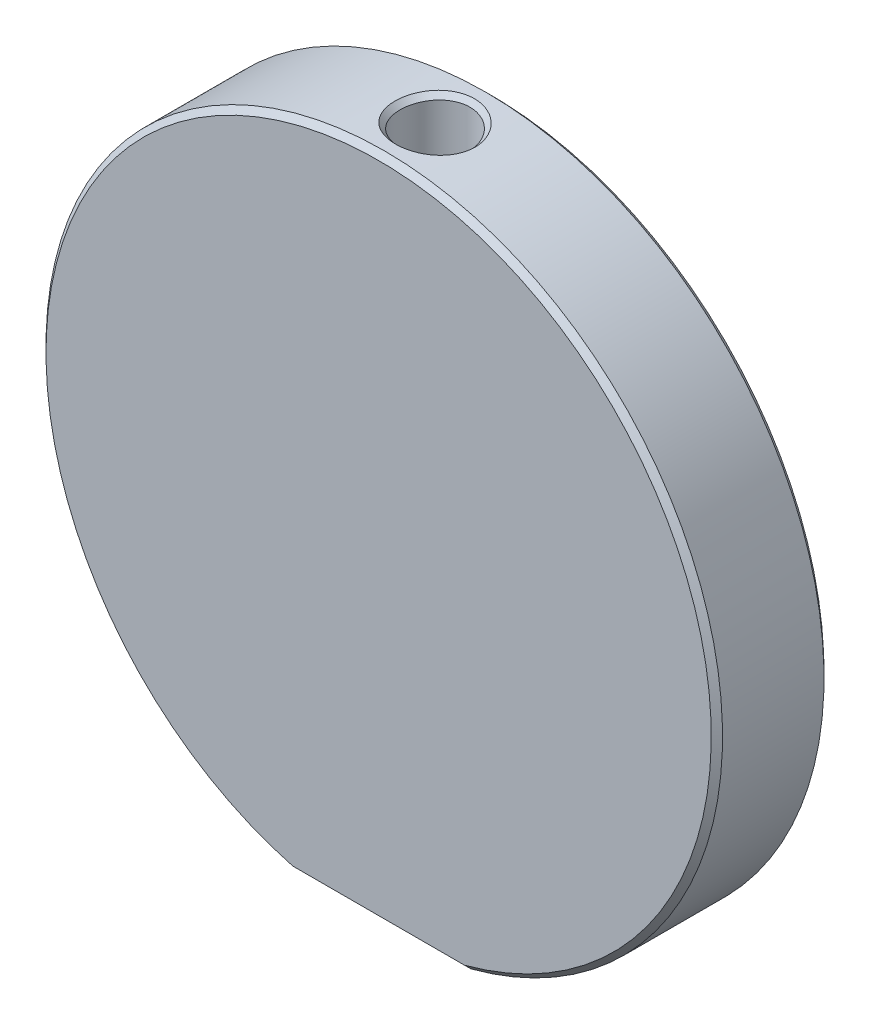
ISO-10303-21;
HEADER;
FILE_DESCRIPTION(('STEP AP214'),'2;1');
FILE_NAME('part.step','',(''),(''),'','','');
FILE_SCHEMA(('AUTOMOTIVE_DESIGN { 1 0 10303 214 1 1 1 1 }'));
ENDSEC;
DATA;
#1=APPLICATION_CONTEXT('core data for automotive mechanical design processes');
#2=APPLICATION_PROTOCOL_DEFINITION('international standard','automotive_design',2000,#1);
#3=PRODUCT_CONTEXT('',#1,'mechanical');
#4=PRODUCT('Part','Part','',(#3));
#5=PRODUCT_RELATED_PRODUCT_CATEGORY('part','',(#4));
#6=PRODUCT_DEFINITION_FORMATION('','',#4);
#7=PRODUCT_DEFINITION_CONTEXT('part definition',#1,'design');
#8=PRODUCT_DEFINITION('design','',#6,#7);
#9=PRODUCT_DEFINITION_SHAPE('','',#8);
#10=(LENGTH_UNIT() NAMED_UNIT(*) SI_UNIT(.MILLI.,.METRE.));
#11=(NAMED_UNIT(*) PLANE_ANGLE_UNIT() SI_UNIT($,.RADIAN.));
#12=(NAMED_UNIT(*) SI_UNIT($,.STERADIAN.) SOLID_ANGLE_UNIT());
#13=UNCERTAINTY_MEASURE_WITH_UNIT(LENGTH_MEASURE(1.E-05),#10,'distance_accuracy_value','');
#14=(GEOMETRIC_REPRESENTATION_CONTEXT(3) GLOBAL_UNCERTAINTY_ASSIGNED_CONTEXT((#13)) GLOBAL_UNIT_ASSIGNED_CONTEXT((#10,
#11,#12)) REPRESENTATION_CONTEXT('',''));
#15=CARTESIAN_POINT('',(0.,0.,0.));
#16=DIRECTION('',(0.,0.,1.));
#17=DIRECTION('',(1.,0.,0.));
#18=AXIS2_PLACEMENT_3D('',#15,#16,#17);
#19=CARTESIAN_POINT('',(0.,0.,10.));
#20=DIRECTION('',(0.,0.,-1.));
#21=DIRECTION('',(-1.,0.,0.));
#22=AXIS2_PLACEMENT_3D('',#19,#20,#21);
#23=CYLINDRICAL_SURFACE('',#22,30.);
#24=CARTESIAN_POINT('',(0.,30.,8.49622965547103));
#25=CARTESIAN_POINT('',(0.0581524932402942,30.0000037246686,8.49626685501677));
#26=CARTESIAN_POINT('',(0.116303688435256,29.9998162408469,8.49483340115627));
#27=CARTESIAN_POINT('',(0.232400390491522,29.9990787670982,8.48907296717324));
#28=CARTESIAN_POINT('',(0.290346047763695,29.9985291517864,8.48474897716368));
#29=CARTESIAN_POINT('',(0.405906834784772,29.9970877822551,8.47325936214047));
#30=CARTESIAN_POINT('',(0.463522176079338,29.9961962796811,8.46609582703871));
#31=CARTESIAN_POINT('',(0.578299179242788,29.9940916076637,8.44897973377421));
#32=CARTESIAN_POINT('',(0.635461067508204,29.9928786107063,8.43902867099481));
#33=CARTESIAN_POINT('',(0.749207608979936,29.9901513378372,8.4163895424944));
#34=CARTESIAN_POINT('',(0.805792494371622,29.9886371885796,8.40370262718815));
#35=CARTESIAN_POINT('',(0.918261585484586,29.9853279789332,8.37564364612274));
#36=CARTESIAN_POINT('',(0.974146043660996,29.9835330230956,8.36027257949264));
#37=CARTESIAN_POINT('',(1.08509077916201,29.9796825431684,8.32689693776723));
#38=CARTESIAN_POINT('',(1.1401513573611,29.9776271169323,8.3088933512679));
#39=CARTESIAN_POINT('',(1.24932480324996,29.973276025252,8.27030417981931));
#40=CARTESIAN_POINT('',(1.30343805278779,29.970980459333,8.24971966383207));
#41=CARTESIAN_POINT('',(1.41059327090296,29.9661694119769,8.20602005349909));
#42=CARTESIAN_POINT('',(1.4636357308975,29.9636540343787,8.18290615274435));
#43=CARTESIAN_POINT('',(1.56852576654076,29.958423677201,8.13419915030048));
#44=CARTESIAN_POINT('',(1.62037395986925,29.9557088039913,8.10860736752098));
#45=CARTESIAN_POINT('',(1.72275184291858,29.9500998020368,8.0549959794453));
#46=CARTESIAN_POINT('',(1.77328227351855,29.9472057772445,8.02697777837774));
#47=CARTESIAN_POINT('',(1.87290100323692,29.941258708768,7.9685649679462));
#48=CARTESIAN_POINT('',(1.92199013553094,29.9382057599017,7.93817177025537));
#49=CARTESIAN_POINT('',(2.01860271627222,29.9319615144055,7.87506047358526));
#50=CARTESIAN_POINT('',(2.06612702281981,29.9287702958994,7.84234368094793));
#51=CARTESIAN_POINT('',(2.15948631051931,29.9222685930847,7.77463675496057));
#52=CARTESIAN_POINT('',(2.20532206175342,29.9189581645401,7.73964767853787));
#53=CARTESIAN_POINT('',(2.29518131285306,29.9122430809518,7.66744810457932));
#54=CARTESIAN_POINT('',(2.33920532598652,29.9088384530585,7.63023824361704));
#55=CARTESIAN_POINT('',(2.42531612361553,29.9019378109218,7.5536483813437));
#56=CARTESIAN_POINT('',(2.46740293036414,29.8984417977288,7.51426840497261));
#57=CARTESIAN_POINT('',(2.54948087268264,29.8914476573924,7.43343417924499));
#58=CARTESIAN_POINT('',(2.58947334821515,29.8879495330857,7.39198129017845));
#59=CARTESIAN_POINT('',(2.66727002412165,29.8810410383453,7.30716320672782));
#60=CARTESIAN_POINT('',(2.7050769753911,29.8776305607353,7.26380054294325));
#61=CARTESIAN_POINT('',(2.7784475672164,29.8709006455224,7.17528476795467));
#62=CARTESIAN_POINT('',(2.81401342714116,29.8675811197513,7.13013350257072));
#63=CARTESIAN_POINT('',(2.88284887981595,29.8610585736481,7.03816284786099));
#64=CARTESIAN_POINT('',(2.9161203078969,29.8578554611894,6.99134483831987));
#65=CARTESIAN_POINT('',(2.9803131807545,29.8515852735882,6.89616261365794));
#66=CARTESIAN_POINT('',(3.0112362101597,29.8485181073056,6.84779947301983));
#67=CARTESIAN_POINT('',(3.07067859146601,29.8425409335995,6.74964880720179));
#68=CARTESIAN_POINT('',(3.09919938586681,29.8396308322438,6.69986216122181));
#69=CARTESIAN_POINT('',(3.15378344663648,29.8339884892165,6.59898618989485));
#70=CARTESIAN_POINT('',(3.17984809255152,29.8312561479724,6.54789761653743));
#71=CARTESIAN_POINT('',(3.22946593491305,29.8259901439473,6.44453943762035));
#72=CARTESIAN_POINT('',(3.25302049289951,29.8234563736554,6.39227049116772));
#73=CARTESIAN_POINT('',(3.29756418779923,29.8186083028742,6.28667318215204));
#74=CARTESIAN_POINT('',(3.318554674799,29.8162938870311,6.23334539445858));
#75=CARTESIAN_POINT('',(3.35791624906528,29.8119053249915,6.12575201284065));
#76=CARTESIAN_POINT('',(3.37628863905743,29.8098310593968,6.07148690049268));
#77=CARTESIAN_POINT('',(3.41036007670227,29.8059435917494,5.96214048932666));
#78=CARTESIAN_POINT('',(3.42606029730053,29.8041302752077,5.90705956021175));
#79=CARTESIAN_POINT('',(3.45473353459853,29.8007854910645,5.79620315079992));
#80=CARTESIAN_POINT('',(3.46770746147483,29.7992539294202,5.74042790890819));
#81=CARTESIAN_POINT('',(3.49087439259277,29.7964934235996,5.62830453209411));
#82=CARTESIAN_POINT('',(3.50106785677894,29.7952644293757,5.57195649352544));
#83=CARTESIAN_POINT('',(3.51862030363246,29.7931298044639,5.45880916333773));
#84=CARTESIAN_POINT('',(3.52597905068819,29.7922242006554,5.40200983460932));
#85=CARTESIAN_POINT('',(3.53780886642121,29.790757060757,5.28808163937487));
#86=CARTESIAN_POINT('',(3.54227869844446,29.79019567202,5.2309526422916));
#87=CARTESIAN_POINT('',(3.54827737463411,29.7894376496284,5.11648644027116));
#88=CARTESIAN_POINT('',(3.54980361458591,29.7892413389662,5.05914909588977));
#89=CARTESIAN_POINT('',(3.54986370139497,29.7892340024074,4.94447435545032));
#90=CARTESIAN_POINT('',(3.54839762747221,29.7894229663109,4.88713695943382));
#91=CARTESIAN_POINT('',(3.54252112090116,29.7901662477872,4.77267025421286));
#92=CARTESIAN_POINT('',(3.53811343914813,29.7907202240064,4.71554080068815));
#93=CARTESIAN_POINT('',(3.5264088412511,29.7921725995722,4.60161096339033));
#94=CARTESIAN_POINT('',(3.51911329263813,29.7930708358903,4.54481043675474));
#95=CARTESIAN_POINT('',(3.50168804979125,29.7951908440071,4.4316596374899));
#96=CARTESIAN_POINT('',(3.49155870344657,29.7964125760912,4.37530931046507));
#97=CARTESIAN_POINT('',(3.46852049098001,29.7991587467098,4.26317994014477));
#98=CARTESIAN_POINT('',(3.45561125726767,29.8006832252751,4.20740097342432));
#99=CARTESIAN_POINT('',(3.42706762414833,29.8040140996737,4.09653535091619));
#100=CARTESIAN_POINT('',(3.41143238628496,29.8058205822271,4.04144891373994));
#101=CARTESIAN_POINT('',(3.37749085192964,29.8096947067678,3.93208937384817));
#102=CARTESIAN_POINT('',(3.35918343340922,29.8117624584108,3.8778166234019));
#103=CARTESIAN_POINT('',(3.31995146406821,29.8161383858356,3.77020550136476));
#104=CARTESIAN_POINT('',(3.29902564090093,29.8184466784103,3.71686759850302));
#105=CARTESIAN_POINT('',(3.254610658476,29.8232829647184,3.61124724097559));
#106=CARTESIAN_POINT('',(3.23112015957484,29.8258110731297,3.55896535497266));
#107=CARTESIAN_POINT('',(3.18162954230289,29.8310662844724,3.45557812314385));
#108=CARTESIAN_POINT('',(3.15562805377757,29.8337934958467,3.40447343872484));
#109=CARTESIAN_POINT('',(3.10116913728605,29.8394261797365,3.30356171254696));
#110=CARTESIAN_POINT('',(3.07271030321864,29.8423317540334,3.25375543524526));
#111=CARTESIAN_POINT('',(3.01339038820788,29.8483005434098,3.15556161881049));
#112=CARTESIAN_POINT('',(2.98252782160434,29.8513638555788,3.10717498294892));
#113=CARTESIAN_POINT('',(2.91845415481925,29.8576270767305,3.01194150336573));
#114=CARTESIAN_POINT('',(2.88524141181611,29.8608270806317,2.96509577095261));
#115=CARTESIAN_POINT('',(2.81652126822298,29.8673442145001,2.87306510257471));
#116=CARTESIAN_POINT('',(2.78101196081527,29.870661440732,2.82788159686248));
#117=CARTESIAN_POINT('',(2.70775234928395,29.8773876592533,2.73929619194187));
#118=CARTESIAN_POINT('',(2.66999974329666,29.8807967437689,2.69589620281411));
#119=CARTESIAN_POINT('',(2.5923085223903,29.8877033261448,2.61099877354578));
#120=CARTESIAN_POINT('',(2.55236706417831,29.8912009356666,2.56950394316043));
#121=CARTESIAN_POINT('',(2.47039305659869,29.8981951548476,2.48858013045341));
#122=CARTESIAN_POINT('',(2.42835919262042,29.9016917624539,2.44915247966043));
#123=CARTESIAN_POINT('',(2.34235936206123,29.9085947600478,2.37246177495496));
#124=CARTESIAN_POINT('',(2.29839350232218,29.9120011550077,2.335198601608));
#125=CARTESIAN_POINT('',(2.20865293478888,29.9187207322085,2.26288846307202));
#126=CARTESIAN_POINT('',(2.16287781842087,29.9220338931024,2.22784200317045));
#127=CARTESIAN_POINT('',(2.06964049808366,29.9285419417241,2.1600168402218));
#128=CARTESIAN_POINT('',(2.02217759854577,29.9317367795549,2.12723908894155));
#129=CARTESIAN_POINT('',(1.92568658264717,29.9379890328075,2.06400314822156));
#130=CARTESIAN_POINT('',(1.87665764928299,29.9410463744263,2.03354619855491));
#131=CARTESIAN_POINT('',(1.77715619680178,29.9470028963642,1.97500381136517));
#132=CARTESIAN_POINT('',(1.72668285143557,29.9499019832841,1.9469197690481));
#133=CARTESIAN_POINT('',(1.62441412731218,29.9555216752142,1.89317528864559));
#134=CARTESIAN_POINT('',(1.57261798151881,29.958242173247,1.86751629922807));
#135=CARTESIAN_POINT('',(1.46782514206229,29.9634842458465,1.81867412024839));
#136=CARTESIAN_POINT('',(1.41482777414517,29.9660057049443,1.79549236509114));
#137=CARTESIAN_POINT('',(1.30775394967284,29.970829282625,1.75165692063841));
#138=CARTESIAN_POINT('',(1.25367691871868,29.9731312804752,1.73100462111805));
#139=CARTESIAN_POINT('',(1.14456522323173,29.9774955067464,1.69228038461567));
#140=CARTESIAN_POINT('',(1.08953007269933,29.979557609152,1.67420980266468));
#141=CARTESIAN_POINT('',(0.978623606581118,29.9834216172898,1.64070129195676));
#142=CARTESIAN_POINT('',(0.922751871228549,29.9852233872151,1.62526473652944));
#143=CARTESIAN_POINT('',(0.810293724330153,29.9885463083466,1.59707650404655));
#144=CARTESIAN_POINT('',(0.753706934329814,29.990067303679,1.58432631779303));
#145=CARTESIAN_POINT('',(0.639940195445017,29.9928082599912,1.56156299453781));
#146=CARTESIAN_POINT('',(0.58275989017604,29.9940280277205,1.55155161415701));
#147=CARTESIAN_POINT('',(0.467927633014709,29.9961461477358,1.53431775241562));
#148=CARTESIAN_POINT('',(0.410275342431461,29.9970442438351,1.52709749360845));
#149=CARTESIAN_POINT('',(0.294620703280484,29.998498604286,1.51549816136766));
#150=CARTESIAN_POINT('',(0.236618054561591,29.9990545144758,1.51112203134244));
#151=CARTESIAN_POINT('',(0.120383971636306,29.9998043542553,1.50526059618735));
#152=CARTESIAN_POINT('',(0.0621523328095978,29.9999977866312,1.50377926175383));
#153=CARTESIAN_POINT('',(-0.0543382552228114,30.0000017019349,1.50376568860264));
#154=CARTESIAN_POINT('',(-0.112597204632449,29.9998120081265,1.50523481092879));
#155=CARTESIAN_POINT('',(-0.228935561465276,29.9990687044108,1.51108159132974));
#156=CARTESIAN_POINT('',(-0.287015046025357,29.9985152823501,1.51545774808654));
#157=CARTESIAN_POINT('',(-0.402866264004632,29.9970653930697,1.52706157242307));
#158=CARTESIAN_POINT('',(-0.460638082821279,29.9961690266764,1.534288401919));
#159=CARTESIAN_POINT('',(-0.575745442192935,29.9940538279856,1.55153936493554));
#160=CARTESIAN_POINT('',(-0.633081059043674,29.9928350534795,1.56156299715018));
#161=CARTESIAN_POINT('',(-0.747187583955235,29.9900956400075,1.5843530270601));
#162=CARTESIAN_POINT('',(-0.803958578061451,29.9885750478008,1.59711899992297));
#163=CARTESIAN_POINT('',(-0.916807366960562,29.9852525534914,1.62533960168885));
#164=CARTESIAN_POINT('',(-0.972885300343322,29.9834507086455,1.64079368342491));
#165=CARTESIAN_POINT('',(-1.08421942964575,29.9795862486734,1.67433654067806));
#166=CARTESIAN_POINT('',(-1.13947587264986,29.9775237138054,1.69242450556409));
#167=CARTESIAN_POINT('',(-1.24903841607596,29.9731584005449,1.73118131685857));
#168=CARTESIAN_POINT('',(-1.30334493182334,29.9708557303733,1.75184900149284));
#169=CARTESIAN_POINT('',(-1.41087895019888,29.9660306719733,1.79571152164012));
#170=CARTESIAN_POINT('',(-1.46410709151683,29.9635084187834,1.81890480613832));
#171=CARTESIAN_POINT('',(-1.56935562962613,29.9582647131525,1.86776483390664));
#172=CARTESIAN_POINT('',(-1.62137693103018,29.9555434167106,1.89342964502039));
#173=CARTESIAN_POINT('',(-1.72408301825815,29.9499221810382,1.94717902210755));
#174=CARTESIAN_POINT('',(-1.77476899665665,29.9470224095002,1.97526132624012));
#175=CARTESIAN_POINT('',(-1.87467562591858,29.9410646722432,2.03379194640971));
#176=CARTESIAN_POINT('',(-1.92389775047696,29.9380068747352,2.06423776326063));
#177=CARTESIAN_POINT('',(-2.02074793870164,29.9317539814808,2.12744153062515));
#178=CARTESIAN_POINT('',(-2.06837771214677,29.9285590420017,2.16019687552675));
#179=CARTESIAN_POINT('',(-2.16191425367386,29.9220511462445,2.22796585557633));
#180=CARTESIAN_POINT('',(-2.20782287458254,29.9187383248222,2.26297694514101));
#181=CARTESIAN_POINT('',(-2.29778923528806,29.9120200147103,2.33520279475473));
#182=CARTESIAN_POINT('',(-2.34184881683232,29.908614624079,2.37241526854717));
#183=CARTESIAN_POINT('',(-2.42798577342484,29.9017139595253,2.4489913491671));
#184=CARTESIAN_POINT('',(-2.47006475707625,29.898218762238,2.48835315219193));
#185=CARTESIAN_POINT('',(-2.55209916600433,29.8912274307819,2.56914327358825));
#186=CARTESIAN_POINT('',(-2.59205684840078,29.8877313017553,2.61056930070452));
#187=CARTESIAN_POINT('',(-2.6697797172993,29.8808274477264,2.69533612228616));
#188=CARTESIAN_POINT('',(-2.7075476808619,29.8774196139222,2.73867436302));
#189=CARTESIAN_POINT('',(-2.7808354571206,29.8706953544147,2.82714407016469));
#190=CARTESIAN_POINT('',(-2.8163575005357,29.8673788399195,2.87227368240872));
#191=CARTESIAN_POINT('',(-2.88510127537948,29.8608627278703,2.96420271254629));
#192=CARTESIAN_POINT('',(-2.91832484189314,29.8576630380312,3.01100075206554));
#193=CARTESIAN_POINT('',(-2.98241835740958,29.8514000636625,3.10614400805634));
#194=CARTESIAN_POINT('',(-3.01328988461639,29.8483366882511,3.15448815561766));
#195=CARTESIAN_POINT('',(-3.0726261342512,29.8423674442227,3.25260099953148));
#196=CARTESIAN_POINT('',(-3.10109229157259,29.8394614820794,3.30236882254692));
#197=CARTESIAN_POINT('',(-3.15556442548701,29.83382773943,3.40320653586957));
#198=CARTESIAN_POINT('',(-3.18157177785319,29.8310998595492,3.45427567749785));
#199=CARTESIAN_POINT('',(-3.23107285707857,29.8258430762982,3.5575935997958));
#200=CARTESIAN_POINT('',(-3.25456795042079,29.8233140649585,3.60984172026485));
#201=CARTESIAN_POINT('',(-3.29899101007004,29.8184757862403,3.71539520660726));
#202=CARTESIAN_POINT('',(-3.31992034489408,29.8161664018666,3.76869999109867));
#203=CARTESIAN_POINT('',(-3.35915837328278,29.8117881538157,3.87624441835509));
#204=CARTESIAN_POINT('',(-3.37746840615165,29.8097191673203,3.93048356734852));
#205=CARTESIAN_POINT('',(-3.41141435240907,29.8058424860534,4.03977432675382));
#206=CARTESIAN_POINT('',(-3.42705149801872,29.8040346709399,4.09482555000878));
#207=CARTESIAN_POINT('',(-3.45559824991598,29.8007010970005,4.20561804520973));
#208=CARTESIAN_POINT('',(-3.46850885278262,29.7991752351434,4.26135905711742));
#209=CARTESIAN_POINT('',(-3.49154930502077,29.7964263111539,4.3734086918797));
#210=CARTESIAN_POINT('',(-3.50167973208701,29.7952031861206,4.42971719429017));
#211=CARTESIAN_POINT('',(-3.51910652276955,29.7930804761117,4.5427793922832));
#212=CARTESIAN_POINT('',(-3.52640280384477,29.7921809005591,4.59953310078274));
#213=CARTESIAN_POINT('',(-3.53810928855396,29.7907259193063,4.71336320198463));
#214=CARTESIAN_POINT('',(-3.54251844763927,29.7901706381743,4.7704397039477));
#215=CARTESIAN_POINT('',(-3.54839505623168,29.7894251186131,4.88479331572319));
#216=CARTESIAN_POINT('',(-3.54986013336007,29.7892351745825,4.94207055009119));
#217=CARTESIAN_POINT('',(-3.54980801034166,29.7892400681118,5.0566270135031));
#218=CARTESIAN_POINT('',(-3.54829062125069,29.7894349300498,5.11390624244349));
#219=CARTESIAN_POINT('',(-3.54233045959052,29.7901887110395,5.22826873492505));
#220=CARTESIAN_POINT('',(-3.53788973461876,29.7907473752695,5.28535210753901));
#221=CARTESIAN_POINT('',(-3.52613254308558,29.7922081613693,5.39920082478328));
#222=CARTESIAN_POINT('',(-3.51881688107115,29.7931101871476,5.45596625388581));
#223=CARTESIAN_POINT('',(-3.50136295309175,29.7952368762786,5.56905686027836));
#224=CARTESIAN_POINT('',(-3.49122458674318,29.7964615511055,5.62538202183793));
#225=CARTESIAN_POINT('',(-3.46817701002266,29.7992128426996,5.73746999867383));
#226=CARTESIAN_POINT('',(-3.45526707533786,29.8007395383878,5.79323266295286));
#227=CARTESIAN_POINT('',(-3.42672812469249,29.8040741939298,5.90407355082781));
#228=CARTESIAN_POINT('',(-3.41109798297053,29.8058822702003,5.95915148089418));
#229=CARTESIAN_POINT('',(-3.37717008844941,29.8097590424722,6.06850080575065));
#230=CARTESIAN_POINT('',(-3.35887097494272,29.8118278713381,6.12277177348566));
#231=CARTESIAN_POINT('',(-3.31965646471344,29.8162055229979,6.23038505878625));
#232=CARTESIAN_POINT('',(-3.2987395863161,29.818514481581,6.28372683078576));
#233=CARTESIAN_POINT('',(-3.25434075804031,29.8233517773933,6.3893595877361));
#234=CARTESIAN_POINT('',(-3.23085727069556,29.8258802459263,6.44164992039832));
#235=CARTESIAN_POINT('',(-3.18137637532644,29.8311359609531,6.54505764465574));
#236=CARTESIAN_POINT('',(-3.15537739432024,29.833863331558,6.59617427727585));
#237=CARTESIAN_POINT('',(-3.10091664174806,29.8394962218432,6.69711244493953));
#238=CARTESIAN_POINT('',(-3.07245324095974,29.8424018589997,6.7469330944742));
#239=CARTESIAN_POINT('',(-3.01311480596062,29.8483707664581,6.8451571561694));
#240=CARTESIAN_POINT('',(-2.98223802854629,29.8514341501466,6.89355950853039));
#241=CARTESIAN_POINT('',(-2.91812403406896,29.8576976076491,6.98882489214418));
#242=CARTESIAN_POINT('',(-2.88488486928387,29.8608977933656,7.03568660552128));
#243=CARTESIAN_POINT('',(-2.81609746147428,29.8674154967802,7.1277486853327));
#244=CARTESIAN_POINT('',(-2.78054694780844,29.870733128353,7.17294734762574));
#245=CARTESIAN_POINT('',(-2.7071880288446,29.8774604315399,7.26156153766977));
#246=CARTESIAN_POINT('',(-2.6693768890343,29.8808702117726,7.30497479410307));
#247=CARTESIAN_POINT('',(-2.59154913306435,29.887778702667,7.38989617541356));
#248=CARTESIAN_POINT('',(-2.55152916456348,29.8912775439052,7.43140121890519));
#249=CARTESIAN_POINT('',(-2.469381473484,29.8982738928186,7.5123374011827));
#250=CARTESIAN_POINT('',(-2.42725210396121,29.9017713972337,7.55176686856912));
#251=CARTESIAN_POINT('',(-2.34105191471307,29.9086750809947,7.62845042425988));
#252=CARTESIAN_POINT('',(-2.29698109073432,29.9120812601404,7.66570450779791));
#253=CARTESIAN_POINT('',(-2.2070241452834,29.9187995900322,7.73798736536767));
#254=CARTESIAN_POINT('',(-2.16113751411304,29.9221117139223,7.77301550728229));
#255=CARTESIAN_POINT('',(-2.06767369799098,29.9286169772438,7.84079668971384));
#256=CARTESIAN_POINT('',(-2.02009574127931,29.9318100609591,7.87354867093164));
#257=CARTESIAN_POINT('',(-1.92337408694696,29.9380582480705,7.93672743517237));
#258=CARTESIAN_POINT('',(-1.87422953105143,29.9411132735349,7.96715291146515));
#259=CARTESIAN_POINT('',(-1.77449925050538,29.9470647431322,8.02562840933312));
#260=CARTESIAN_POINT('',(-1.72391269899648,29.9499610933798,8.05367702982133));
#261=CARTESIAN_POINT('',(-1.62142291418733,29.9555750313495,8.10734839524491));
#262=CARTESIAN_POINT('',(-1.56951895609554,29.9582925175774,8.13296976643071));
#263=CARTESIAN_POINT('',(-1.4645187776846,29.9635284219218,8.18173608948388));
#264=CARTESIAN_POINT('',(-1.41142196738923,29.9660467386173,8.2048797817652));
#265=CARTESIAN_POINT('',(-1.30416047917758,29.9708640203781,8.24864011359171));
#266=CARTESIAN_POINT('',(-1.24999534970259,29.9731628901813,8.26925565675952));
#267=CARTESIAN_POINT('',(-1.14072161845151,29.9775209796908,8.30790900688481));
#268=CARTESIAN_POINT('',(-1.08561268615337,29.9795801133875,8.32594588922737));
#269=CARTESIAN_POINT('',(-0.974575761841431,29.9834384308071,8.35939122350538));
#270=CARTESIAN_POINT('',(-0.918647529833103,29.9852375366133,8.37479888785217));
#271=CARTESIAN_POINT('',(-0.806096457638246,29.9885554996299,8.40293513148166));
#272=CARTESIAN_POINT('',(-0.749473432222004,29.9900742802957,8.41566297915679));
#273=CARTESIAN_POINT('',(-0.635657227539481,29.9928112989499,8.43838899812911));
#274=CARTESIAN_POINT('',(-0.578463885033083,29.9940294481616,8.44838636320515));
#275=CARTESIAN_POINT('',(-0.463631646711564,29.9961449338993,8.46560102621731));
#276=CARTESIAN_POINT('',(-0.405992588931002,29.9970421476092,8.47281725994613));
#277=CARTESIAN_POINT('',(-0.290393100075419,29.9984954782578,8.48441919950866));
#278=CARTESIAN_POINT('',(-0.232432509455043,29.9990514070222,8.48880334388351));
#279=CARTESIAN_POINT('',(-0.116315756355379,29.9998020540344,8.49469184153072));
#280=CARTESIAN_POINT('',(-0.0581594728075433,29.999996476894,8.49619383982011));
#281=CARTESIAN_POINT('',(0.,30.,8.49622965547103));
#282=B_SPLINE_CURVE_WITH_KNOTS('',3,(#24,#25,#26,#27,#28,#29,#30,#31,#32,#33,#34,#35,#36,#37,
#38,#39,#40,#41,#42,#43,#44,#45,#46,#47,#48,#49,#50,#51,#52,#53,#54,#55,#56,#57,#58,#59,#60,#61,
#62,#63,#64,#65,#66,#67,#68,#69,#70,#71,#72,#73,#74,#75,#76,#77,#78,#79,#80,#81,#82,#83,#84,#85,
#86,#87,#88,#89,#90,#91,#92,#93,#94,#95,#96,#97,#98,#99,#100,#101,#102,#103,#104,#105,#106,#107,
#108,#109,#110,#111,#112,#113,#114,#115,#116,#117,#118,#119,#120,#121,#122,#123,#124,#125,#126,
#127,#128,#129,#130,#131,#132,#133,#134,#135,#136,#137,#138,#139,#140,#141,#142,#143,#144,#145,
#146,#147,#148,#149,#150,#151,#152,#153,#154,#155,#156,#157,#158,#159,#160,#161,#162,#163,#164,
#165,#166,#167,#168,#169,#170,#171,#172,#173,#174,#175,#176,#177,#178,#179,#180,#181,#182,#183,
#184,#185,#186,#187,#188,#189,#190,#191,#192,#193,#194,#195,#196,#197,#198,#199,#200,#201,#202,
#203,#204,#205,#206,#207,#208,#209,#210,#211,#212,#213,#214,#215,#216,#217,#218,#219,#220,#221,
#222,#223,#224,#225,#226,#227,#228,#229,#230,#231,#232,#233,#234,#235,#236,#237,#238,#239,#240,
#241,#242,#243,#244,#245,#246,#247,#248,#249,#250,#251,#252,#253,#254,#255,#256,#257,#258,#259,
#260,#261,#262,#263,#264,#265,#266,#267,#268,#269,#270,#271,#272,#273,#274,#275,#276,#277,#278,
#279,#280,#281),.UNSPECIFIED.,.F.,.F.,(4,2,2,2,2,2,2,2,2,2,2,2,2,2,2,2,2,2,2,2,2,2,2,2,2,2,2,2,
2,2,2,2,2,2,2,2,2,2,2,2,2,2,2,2,2,2,2,2,2,2,2,2,2,2,2,2,2,2,2,2,2,2,2,2,2,2,2,2,2,2,2,2,2,2,2,2,
2,2,2,2,2,2,2,2,2,2,2,2,2,2,2,2,2,2,2,2,2,2,2,2,2,2,2,2,2,2,2,2,2,2,2,2,2,2,2,2,2,2,2,2,2,2,2,2,
2,2,2,2,4),(0.,0.174435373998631,0.348690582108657,0.522817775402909,0.696851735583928,
0.87081265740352,1.04470896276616,1.21854013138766,1.39229953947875,1.56597730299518,
1.73956312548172,1.91304915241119,2.08643283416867,2.25971979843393,2.43292672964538,
2.60608424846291,2.77923977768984,2.95228313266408,3.12510371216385,3.29775036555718,
3.47025727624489,3.64264673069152,3.81493191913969,3.98711975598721,4.15921371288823,
4.33121666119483,4.5031337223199,4.67497512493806,4.84675906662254,5.01851457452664,
5.1902843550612,5.36212761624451,5.53412283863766,5.70611350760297,5.87794356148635,
6.04969234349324,6.22142005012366,6.39317047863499,6.56497382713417,6.73684952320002,
6.90880906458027,7.08085886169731,7.25300307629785,7.4252464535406,7.59759714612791,
7.77006952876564,7.94268699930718,8.11548475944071,8.28851256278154,8.46165048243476,
8.6347788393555,8.80794651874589,8.9811864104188,9.15451820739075,9.32795121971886,
9.50148719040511,9.67512310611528,9.84885399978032,10.0226757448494,10.196587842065,
10.3705961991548,10.5447159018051,10.7189739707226,10.8934120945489,11.0680893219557,
11.2428471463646,11.4175147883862,11.5921311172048,11.7667161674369,11.9412741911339,
12.1157967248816,12.2902656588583,12.4646563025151,12.6389404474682,12.8130894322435,
12.9870772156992,13.1608834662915,13.3344966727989,13.5079172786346,13.681160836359,
13.8542611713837,14.0271734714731,14.1998614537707,14.3723751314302,14.5447494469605,
14.717007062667,14.8891611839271,15.0612184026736,15.2331815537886,15.4050525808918,
15.5768354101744,15.7485388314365,15.9201793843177,16.0917842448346,16.2633941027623,
16.4350660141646,16.6068762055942,16.7786972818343,16.9503981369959,17.1220509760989,
17.2937099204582,17.4654137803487,17.637188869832,17.8090518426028,17.9810125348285,
18.1530768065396,18.3252493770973,18.4975366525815,18.6699495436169,18.842506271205,
19.0152351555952,19.1881773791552,19.3613897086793,19.5347394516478,19.7080895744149,
19.8814887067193,20.0549680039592,20.2285440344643,20.4022216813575,20.5759970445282,
20.749860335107,20.9237987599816,21.097799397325,21.2718520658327,21.4459521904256,
21.620103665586,21.7943217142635,21.9686357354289,22.1430921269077),.UNSPECIFIED.);
#283=CARTESIAN_POINT('',(0.,30.,8.49622965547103));
#284=VERTEX_POINT('',#283);
#285=EDGE_CURVE('E104',#284,#284,#282,.F.);
#286=ORIENTED_EDGE('',*,*,#285,.T.);
#287=EDGE_LOOP('',(#286));
#288=FACE_BOUND('',#287,.T.);
#289=DIRECTION('',(0.,0.,-1.));
#290=VECTOR('',#289,1.);
#291=CARTESIAN_POINT('',(7.68114574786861,-29.,10.));
#292=LINE('',#291,#290);
#293=CARTESIAN_POINT('',(7.68114574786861,-29.,9.49999999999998));
#294=VERTEX_POINT('',#293);
#295=CARTESIAN_POINT('',(7.68114574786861,-29.,0.500000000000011));
#296=VERTEX_POINT('',#295);
#297=EDGE_CURVE('E94',#294,#296,#292,.T.);
#298=ORIENTED_EDGE('',*,*,#297,.T.);
#299=CARTESIAN_POINT('',(0.,0.,0.500000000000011));
#300=DIRECTION('',(0.,0.,1.));
#301=DIRECTION('',(1.,0.,0.));
#302=AXIS2_PLACEMENT_3D('',#299,#300,#301);
#303=CIRCLE('',#302,30.);
#304=CARTESIAN_POINT('',(-7.68114574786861,-29.,0.500000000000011));
#305=VERTEX_POINT('',#304);
#306=EDGE_CURVE('E86',#296,#305,#303,.T.);
#307=ORIENTED_EDGE('',*,*,#306,.T.);
#308=DIRECTION('',(0.,0.,-1.));
#309=VECTOR('',#308,1.);
#310=CARTESIAN_POINT('',(-7.68114574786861,-29.,10.));
#311=LINE('',#310,#309);
#312=CARTESIAN_POINT('',(-7.68114574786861,-29.,9.49999999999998));
#313=VERTEX_POINT('',#312);
#314=EDGE_CURVE('E87',#313,#305,#311,.T.);
#315=ORIENTED_EDGE('',*,*,#314,.F.);
#316=CARTESIAN_POINT('',(0.,0.,9.49999999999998));
#317=DIRECTION('',(0.,0.,1.));
#318=DIRECTION('',(1.,0.,0.));
#319=AXIS2_PLACEMENT_3D('',#316,#317,#318);
#320=CIRCLE('',#319,30.);
#321=EDGE_CURVE('E80',#313,#294,#320,.F.);
#322=ORIENTED_EDGE('',*,*,#321,.T.);
#323=EDGE_LOOP('',(#298,#307,#315,#322));
#324=FACE_BOUND('',#323,.T.);
#325=ADVANCED_FACE('F31',(#288,#324),#23,.T.);
#326=CARTESIAN_POINT('',(-7.68114574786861,-29.,10.));
#327=DIRECTION('',(0.,1.,0.));
#328=DIRECTION('',(0.,0.,1.));
#329=AXIS2_PLACEMENT_3D('',#326,#327,#328);
#330=PLANE('',#329);
#331=CARTESIAN_POINT('',(0.,-29.,5.));
#332=DIRECTION('',(0.,1.,0.));
#333=DIRECTION('',(0.,0.,1.));
#334=AXIS2_PLACEMENT_3D('',#331,#332,#333);
#335=CIRCLE('',#334,3.59999999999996);
#336=CARTESIAN_POINT('',(0.,-29.,8.59999999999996));
#337=VERTEX_POINT('',#336);
#338=EDGE_CURVE('E261',#337,#337,#335,.T.);
#339=ORIENTED_EDGE('',*,*,#338,.T.);
#340=EDGE_LOOP('',(#339));
#341=FACE_BOUND('',#340,.T.);
#342=ORIENTED_EDGE('',*,*,#314,.T.);
#343=DIRECTION('',(1.,0.,0.));
#344=VECTOR('',#343,1.);
#345=CARTESIAN_POINT('',(-7.68114574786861,-29.,0.500000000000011));
#346=LINE('',#345,#344);
#347=EDGE_CURVE('E95',#305,#296,#346,.T.);
#348=ORIENTED_EDGE('',*,*,#347,.T.);
#349=ORIENTED_EDGE('',*,*,#297,.F.);
#350=DIRECTION('',(-1.,0.,0.));
#351=VECTOR('',#350,1.);
#352=CARTESIAN_POINT('',(-7.68114574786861,-29.,9.49999999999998));
#353=LINE('',#352,#351);
#354=EDGE_CURVE('E77',#294,#313,#353,.T.);
#355=ORIENTED_EDGE('',*,*,#354,.T.);
#356=EDGE_LOOP('',(#342,#348,#349,#355));
#357=FACE_BOUND('',#356,.T.);
#358=ADVANCED_FACE('F91',(#341,#357),#330,.F.);
#359=CARTESIAN_POINT('',(0.,0.,10.));
#360=DIRECTION('',(0.,0.,1.));
#361=DIRECTION('',(1.,0.,0.));
#362=AXIS2_PLACEMENT_3D('',#359,#360,#361);
#363=PLANE('',#362);
#364=CARTESIAN_POINT('',(0.,0.,10.));
#365=DIRECTION('',(0.,0.,1.));
#366=DIRECTION('',(1.,0.,0.));
#367=AXIS2_PLACEMENT_3D('',#364,#365,#366);
#368=CIRCLE('',#367,29.5);
#369=CARTESIAN_POINT('',(7.6157731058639,-28.5,10.));
#370=VERTEX_POINT('',#369);
#371=CARTESIAN_POINT('',(-7.6157731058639,-28.5,10.));
#372=VERTEX_POINT('',#371);
#373=EDGE_CURVE('E44',#370,#372,#368,.T.);
#374=ORIENTED_EDGE('',*,*,#373,.T.);
#375=DIRECTION('',(1.,0.,0.));
#376=VECTOR('',#375,1.);
#377=CARTESIAN_POINT('',(7.68114574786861,-28.5,10.));
#378=LINE('',#377,#376);
#379=EDGE_CURVE('E11',#372,#370,#378,.T.);
#380=ORIENTED_EDGE('',*,*,#379,.T.);
#381=EDGE_LOOP('',(#374,#380));
#382=FACE_BOUND('',#381,.T.);
#383=ADVANCED_FACE('F233',(#382),#363,.T.);
#384=CARTESIAN_POINT('',(0.,0.,0.));
#385=DIRECTION('',(0.,0.,1.));
#386=DIRECTION('',(1.,0.,0.));
#387=AXIS2_PLACEMENT_3D('',#384,#385,#386);
#388=PLANE('',#387);
#389=CARTESIAN_POINT('',(0.,0.,0.));
#390=DIRECTION('',(0.,0.,1.));
#391=DIRECTION('',(1.,0.,0.));
#392=AXIS2_PLACEMENT_3D('',#389,#390,#391);
#393=CIRCLE('',#392,29.5);
#394=CARTESIAN_POINT('',(-7.6157731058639,-28.5,0.));
#395=VERTEX_POINT('',#394);
#396=CARTESIAN_POINT('',(7.6157731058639,-28.5,0.));
#397=VERTEX_POINT('',#396);
#398=EDGE_CURVE('E263',#395,#397,#393,.F.);
#399=ORIENTED_EDGE('',*,*,#398,.T.);
#400=DIRECTION('',(-1.,0.,0.));
#401=VECTOR('',#400,1.);
#402=CARTESIAN_POINT('',(0.,-28.5,0.));
#403=LINE('',#402,#401);
#404=EDGE_CURVE('E265',#397,#395,#403,.T.);
#405=ORIENTED_EDGE('',*,*,#404,.T.);
#406=EDGE_LOOP('',(#399,#405));
#407=FACE_BOUND('',#406,.T.);
#408=ADVANCED_FACE('F223',(#407),#388,.F.);
#409=CARTESIAN_POINT('',(0.,-30.,5.));
#410=DIRECTION('',(0.,1.,0.));
#411=DIRECTION('',(0.,0.,1.));
#412=AXIS2_PLACEMENT_3D('',#409,#410,#411);
#413=CYLINDRICAL_SURFACE('',#412,3.1);
#414=CARTESIAN_POINT('',(0.,29.5469832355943,8.1));
#415=CARTESIAN_POINT('',(-0.81304351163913,29.5469262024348,8.09948236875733));
#416=CARTESIAN_POINT('',(-1.61815486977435,29.4987357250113,7.76611938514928));
#417=CARTESIAN_POINT('',(-2.76653561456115,29.387957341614,6.61731412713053));
#418=CARTESIAN_POINT('',(-3.09959897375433,29.3394450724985,5.81246110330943));
#419=CARTESIAN_POINT('',(-3.10040091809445,29.3393619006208,4.18638084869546));
#420=CARTESIAN_POINT('',(-2.76610509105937,29.3879578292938,3.38205932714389));
#421=CARTESIAN_POINT('',(-1.61969034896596,29.4986305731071,2.23561271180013));
#422=CARTESIAN_POINT('',(-0.810894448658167,29.5470163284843,1.8998826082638));
#423=CARTESIAN_POINT('',(0.817741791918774,29.5469496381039,1.90012117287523));
#424=CARTESIAN_POINT('',(1.62020397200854,29.4986379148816,2.23480214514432));
#425=CARTESIAN_POINT('',(2.76609595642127,29.3879026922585,3.38337483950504));
#426=CARTESIAN_POINT('',(3.1004158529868,29.3393459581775,4.18765454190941));
#427=CARTESIAN_POINT('',(3.09958331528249,29.339461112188,5.81555691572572));
#428=CARTESIAN_POINT('',(2.76423062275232,29.3881465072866,6.61983263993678));
#429=CARTESIAN_POINT('',(1.61693808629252,29.4988799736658,7.76712082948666));
#430=CARTESIAN_POINT('',(0.813043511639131,29.5470402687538,8.10051763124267));
#431=CARTESIAN_POINT('',(0.,29.5469832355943,8.1));
#432=B_SPLINE_CURVE_WITH_KNOTS('',3,(#414,#415,#416,#417,#418,#419,#420,#421,#422,#423,#424,
#425,#426,#427,#428,#429,#430,#431),.UNSPECIFIED.,.T.,.F.,(4,2,2,2,2,2,2,2,4),
(0.000775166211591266,0.00350971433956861,0.00624426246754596,0.0089788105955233,
0.0117133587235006,0.014447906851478,0.0171824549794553,0.0199170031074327,0.02265155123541),.UNSPECIFIED.);
#433=CARTESIAN_POINT('',(0.,29.5469832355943,8.1));
#434=VERTEX_POINT('',#433);
#435=EDGE_CURVE('E96',#434,#434,#432,.F.);
#436=ORIENTED_EDGE('',*,*,#435,.T.);
#437=EDGE_LOOP('',(#436));
#438=FACE_BOUND('',#437,.T.);
#439=CARTESIAN_POINT('',(0.,-28.5,5.));
#440=DIRECTION('',(0.,1.,0.));
#441=DIRECTION('',(0.,0.,1.));
#442=AXIS2_PLACEMENT_3D('',#439,#440,#441);
#443=CIRCLE('',#442,3.1);
#444=CARTESIAN_POINT('',(0.,-28.5,8.1));
#445=VERTEX_POINT('',#444);
#446=EDGE_CURVE('E113',#445,#445,#443,.F.);
#447=ORIENTED_EDGE('',*,*,#446,.T.);
#448=EDGE_LOOP('',(#447));
#449=FACE_BOUND('',#448,.T.);
#450=ADVANCED_FACE('F132',(#438,#449),#413,.F.);
#451=CARTESIAN_POINT('',(0.,30.,8.49622965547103));
#452=CARTESIAN_POINT('',(-0.931021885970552,29.9999420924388,8.49564586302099));
#453=CARTESIAN_POINT('',(-1.85296173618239,29.9510127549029,8.11967375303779));
#454=CARTESIAN_POINT('',(-3.16798147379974,29.8385359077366,6.82403277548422));
#455=CARTESIAN_POINT('',(-3.54937491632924,29.7892798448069,5.91630663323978));
#456=CARTESIAN_POINT('',(-3.55029322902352,29.7891953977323,4.08238730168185));
#457=CARTESIAN_POINT('',(-3.16748847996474,29.838536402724,3.17526059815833));
#458=CARTESIAN_POINT('',(-1.8547200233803,29.9509059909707,1.88227973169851));
#459=CARTESIAN_POINT('',(-0.928561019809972,30.0000336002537,1.50363794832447));
#460=CARTESIAN_POINT('',(0.936401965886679,29.9999658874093,1.50390700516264));
#461=CARTESIAN_POINT('',(1.85530817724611,29.9509134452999,1.8813655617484));
#462=CARTESIAN_POINT('',(3.16747801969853,29.838480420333,3.17674425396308));
#463=CARTESIAN_POINT('',(3.55031033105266,29.7891792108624,4.08382385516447));
#464=CARTESIAN_POINT('',(3.5493569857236,29.7892961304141,5.91979807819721));
#465=CARTESIAN_POINT('',(3.16534201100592,29.8387279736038,6.82687319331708));
#466=CARTESIAN_POINT('',(1.85156838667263,29.9511592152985,8.1208031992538));
#467=CARTESIAN_POINT('',(0.931021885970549,30.0000579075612,8.49681344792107));
#468=CARTESIAN_POINT('',(0.,30.,8.49622965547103));
#469=CARTESIAN_POINT('',(0.,29.5469832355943,8.1));
#470=CARTESIAN_POINT('',(-0.81304351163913,29.5469262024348,8.09948236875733));
#471=CARTESIAN_POINT('',(-1.61815486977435,29.4987357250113,7.76611938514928));
#472=CARTESIAN_POINT('',(-2.76653561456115,29.387957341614,6.61731412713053));
#473=CARTESIAN_POINT('',(-3.09959897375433,29.3394450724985,5.81246110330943));
#474=CARTESIAN_POINT('',(-3.10040091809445,29.3393619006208,4.18638084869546));
#475=CARTESIAN_POINT('',(-2.76610509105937,29.3879578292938,3.38205932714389));
#476=CARTESIAN_POINT('',(-1.61969034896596,29.4986305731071,2.23561271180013));
#477=CARTESIAN_POINT('',(-0.810894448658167,29.5470163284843,1.8998826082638));
#478=CARTESIAN_POINT('',(0.817741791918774,29.5469496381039,1.90012117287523));
#479=CARTESIAN_POINT('',(1.62020397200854,29.4986379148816,2.23480214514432));
#480=CARTESIAN_POINT('',(2.76609595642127,29.3879026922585,3.38337483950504));
#481=CARTESIAN_POINT('',(3.1004158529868,29.3393459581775,4.18765454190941));
#482=CARTESIAN_POINT('',(3.09958331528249,29.339461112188,5.81555691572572));
#483=CARTESIAN_POINT('',(2.76423062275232,29.3881465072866,6.61983263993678));
#484=CARTESIAN_POINT('',(1.61693808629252,29.4988799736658,7.76712082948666));
#485=CARTESIAN_POINT('',(0.813043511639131,29.5470402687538,8.10051763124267));
#486=CARTESIAN_POINT('',(0.,29.5469832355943,8.1));
#487=B_SPLINE_SURFACE_WITH_KNOTS('',1,3,((#451,#452,#453,#454,#455,#456,#457,#458,#459,#460,
#461,#462,#463,#464,#465,#466,#467,#468),(#469,#470,#471,#472,#473,#474,#475,#476,#477,#478,
#479,#480,#481,#482,#483,#484,#485,#486)),.UNSPECIFIED.,.F.,.T.,.F.,(2,2),(4,2,2,2,2,2,2,2,4),
(0.,1.),(0.000775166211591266,0.00350971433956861,0.00624426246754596,0.0089788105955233,
0.0117133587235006,0.014447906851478,0.0171824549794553,0.0199170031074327,0.02265155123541),.UNSPECIFIED.);
#488=ORIENTED_EDGE('',*,*,#435,.F.);
#489=EDGE_LOOP('',(#488));
#490=FACE_BOUND('',#489,.T.);
#491=ORIENTED_EDGE('',*,*,#285,.F.);
#492=EDGE_LOOP('',(#491));
#493=FACE_BOUND('',#492,.T.);
#494=ADVANCED_FACE('F125',(#490,#493),#487,.T.);
#495=CARTESIAN_POINT('',(0.,-29.,5.));
#496=DIRECTION('',(0.,-1.,0.));
#497=DIRECTION('',(0.,0.,-1.));
#498=AXIS2_PLACEMENT_3D('',#495,#496,#497);
#499=CONICAL_SURFACE('',#498,3.59999999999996,0.785398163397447);
#500=ORIENTED_EDGE('',*,*,#446,.F.);
#501=EDGE_LOOP('',(#500));
#502=FACE_BOUND('',#501,.T.);
#503=ORIENTED_EDGE('',*,*,#338,.F.);
#504=EDGE_LOOP('',(#503));
#505=FACE_BOUND('',#504,.T.);
#506=ADVANCED_FACE('F131',(#502,#505),#499,.F.);
#507=CARTESIAN_POINT('',(0.,0.,0.500000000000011));
#508=DIRECTION('',(0.,0.,1.));
#509=DIRECTION('',(1.,0.,0.));
#510=AXIS2_PLACEMENT_3D('',#507,#508,#509);
#511=CONICAL_SURFACE('',#510,30.,0.785398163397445);
#512=CARTESIAN_POINT('',(7.68114574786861,-29.,0.500000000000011));
#513=CARTESIAN_POINT('',(7.67029647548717,-28.9166636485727,0.41666364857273));
#514=CARTESIAN_POINT('',(7.65942411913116,-28.8333288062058,0.333328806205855));
#515=CARTESIAN_POINT('',(7.63763323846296,-28.6666621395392,0.166662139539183));
#516=CARTESIAN_POINT('',(7.62671471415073,-28.5833303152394,0.0833303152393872));
#517=CARTESIAN_POINT('',(7.61577310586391,-28.5,0.));
#518=B_SPLINE_CURVE_WITH_KNOTS('',3,(#512,#513,#514,#515,#516,#517),.UNSPECIFIED.,.F.,.F.,(4,2,
4),(0.,0.355061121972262,0.710122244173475),.UNSPECIFIED.);
#519=EDGE_CURVE('E79',#397,#296,#518,.F.);
#520=ORIENTED_EDGE('',*,*,#519,.F.);
#521=ORIENTED_EDGE('',*,*,#398,.F.);
#522=CARTESIAN_POINT('',(-7.6157731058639,-28.5,0.));
#523=CARTESIAN_POINT('',(-7.62671471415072,-28.5833303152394,0.0833303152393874));
#524=CARTESIAN_POINT('',(-7.63763323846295,-28.6666621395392,0.166662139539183));
#525=CARTESIAN_POINT('',(-7.65942411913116,-28.8333288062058,0.333328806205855));
#526=CARTESIAN_POINT('',(-7.67029647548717,-28.9166636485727,0.41666364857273));
#527=CARTESIAN_POINT('',(-7.68114574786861,-29.,0.500000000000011));
#528=B_SPLINE_CURVE_WITH_KNOTS('',3,(#522,#523,#524,#525,#526,#527),.UNSPECIFIED.,.F.,.F.,(4,2,
4),(0.,0.355061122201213,0.710122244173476),.UNSPECIFIED.);
#529=EDGE_CURVE('E100',#305,#395,#528,.F.);
#530=ORIENTED_EDGE('',*,*,#529,.F.);
#531=ORIENTED_EDGE('',*,*,#306,.F.);
#532=EDGE_LOOP('',(#520,#521,#530,#531));
#533=FACE_BOUND('',#532,.T.);
#534=ADVANCED_FACE('F164',(#533),#511,.T.);
#535=CARTESIAN_POINT('',(-7.68114574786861,-29.,0.500000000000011));
#536=DIRECTION('',(0.,0.70710678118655,0.707106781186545));
#537=DIRECTION('',(0.,-0.707106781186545,0.70710678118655));
#538=AXIS2_PLACEMENT_3D('',#535,#536,#537);
#539=PLANE('',#538);
#540=ORIENTED_EDGE('',*,*,#529,.T.);
#541=ORIENTED_EDGE('',*,*,#404,.F.);
#542=ORIENTED_EDGE('',*,*,#519,.T.);
#543=ORIENTED_EDGE('',*,*,#347,.F.);
#544=EDGE_LOOP('',(#540,#541,#542,#543));
#545=FACE_BOUND('',#544,.T.);
#546=ADVANCED_FACE('F166',(#545),#539,.F.);
#547=CARTESIAN_POINT('',(0.,0.,10.));
#548=DIRECTION('',(0.,0.,-1.));
#549=DIRECTION('',(-1.,0.,0.));
#550=AXIS2_PLACEMENT_3D('',#547,#548,#549);
#551=CONICAL_SURFACE('',#550,29.5,0.785398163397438);
#552=CARTESIAN_POINT('',(7.6157731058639,-28.5,10.));
#553=CARTESIAN_POINT('',(7.62671471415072,-28.5833303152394,9.91666968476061));
#554=CARTESIAN_POINT('',(7.63763323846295,-28.6666621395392,9.83333786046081));
#555=CARTESIAN_POINT('',(7.65942411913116,-28.8333288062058,9.66667119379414));
#556=CARTESIAN_POINT('',(7.67029647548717,-28.9166636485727,9.58333635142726));
#557=CARTESIAN_POINT('',(7.68114574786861,-29.,9.49999999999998));
#558=B_SPLINE_CURVE_WITH_KNOTS('',3,(#552,#553,#554,#555,#556,#557),.UNSPECIFIED.,.F.,.F.,(4,2,
4),(0.,0.355061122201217,0.710122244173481),.UNSPECIFIED.);
#559=EDGE_CURVE('E57',#294,#370,#558,.F.);
#560=ORIENTED_EDGE('',*,*,#559,.F.);
#561=ORIENTED_EDGE('',*,*,#321,.F.);
#562=CARTESIAN_POINT('',(-7.68114574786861,-29.,9.49999999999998));
#563=CARTESIAN_POINT('',(-7.67029647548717,-28.9166636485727,9.58333635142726));
#564=CARTESIAN_POINT('',(-7.65942411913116,-28.8333288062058,9.66667119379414));
#565=CARTESIAN_POINT('',(-7.63763323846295,-28.6666621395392,9.83333786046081));
#566=CARTESIAN_POINT('',(-7.62671471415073,-28.5833303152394,9.91666968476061));
#567=CARTESIAN_POINT('',(-7.6157731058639,-28.5,10.));
#568=B_SPLINE_CURVE_WITH_KNOTS('',3,(#562,#563,#564,#565,#566,#567),.UNSPECIFIED.,.F.,.F.,(4,2,
4),(0.,0.355061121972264,0.71012224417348),.UNSPECIFIED.);
#569=EDGE_CURVE('E36',#372,#313,#568,.F.);
#570=ORIENTED_EDGE('',*,*,#569,.F.);
#571=ORIENTED_EDGE('',*,*,#373,.F.);
#572=EDGE_LOOP('',(#560,#561,#570,#571));
#573=FACE_BOUND('',#572,.T.);
#574=ADVANCED_FACE('F81',(#573),#551,.T.);
#575=CARTESIAN_POINT('',(0.,-28.5,10.));
#576=DIRECTION('',(0.,-0.707106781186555,0.70710678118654));
#577=DIRECTION('',(0.,-0.70710678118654,-0.707106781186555));
#578=AXIS2_PLACEMENT_3D('',#575,#576,#577);
#579=PLANE('',#578);
#580=ORIENTED_EDGE('',*,*,#569,.T.);
#581=ORIENTED_EDGE('',*,*,#354,.F.);
#582=ORIENTED_EDGE('',*,*,#559,.T.);
#583=ORIENTED_EDGE('',*,*,#379,.F.);
#584=EDGE_LOOP('',(#580,#581,#582,#583));
#585=FACE_BOUND('',#584,.T.);
#586=ADVANCED_FACE('F33',(#585),#579,.T.);
#587=CLOSED_SHELL('',(#325,#358,#383,#408,#450,#494,#506,#534,#546,#574,#586));
#588=MANIFOLD_SOLID_BREP('B2',#587);
#589=ADVANCED_BREP_SHAPE_REPRESENTATION('',(#18,#588),#14);
#590=SHAPE_DEFINITION_REPRESENTATION(#9,#589);
ENDSEC;
END-ISO-10303-21;
